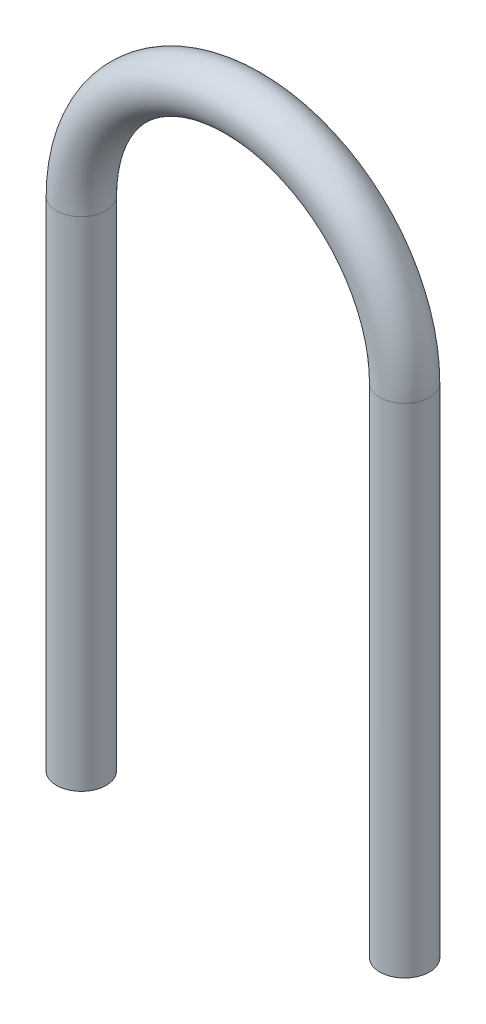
from build123d import *

# Parameters (mm, degrees)
SKETCH1_R = 1.5875


with BuildPart() as part:
    # Sweep1: sweep along a path in Sketch2
    with BuildLine(Plane.XY) as sweep1_path:
        Line((0, 0), (0, 31.75))
        ThreePointArc((0, 31.75), (10.3124, 42.0624), (20.6248, 31.75))
        Line((20.6248, 31.75), (20.6248, 0))
    # Sketch1 → Sweep1 (sweep)
    with BuildSketch(Plane(origin=(0, 0, 0), x_dir=(1, 0, 0), z_dir=(0, 1, 0))):
        Circle(SKETCH1_R)
    sweep(path=sweep1_path.line)


solid = part.part
